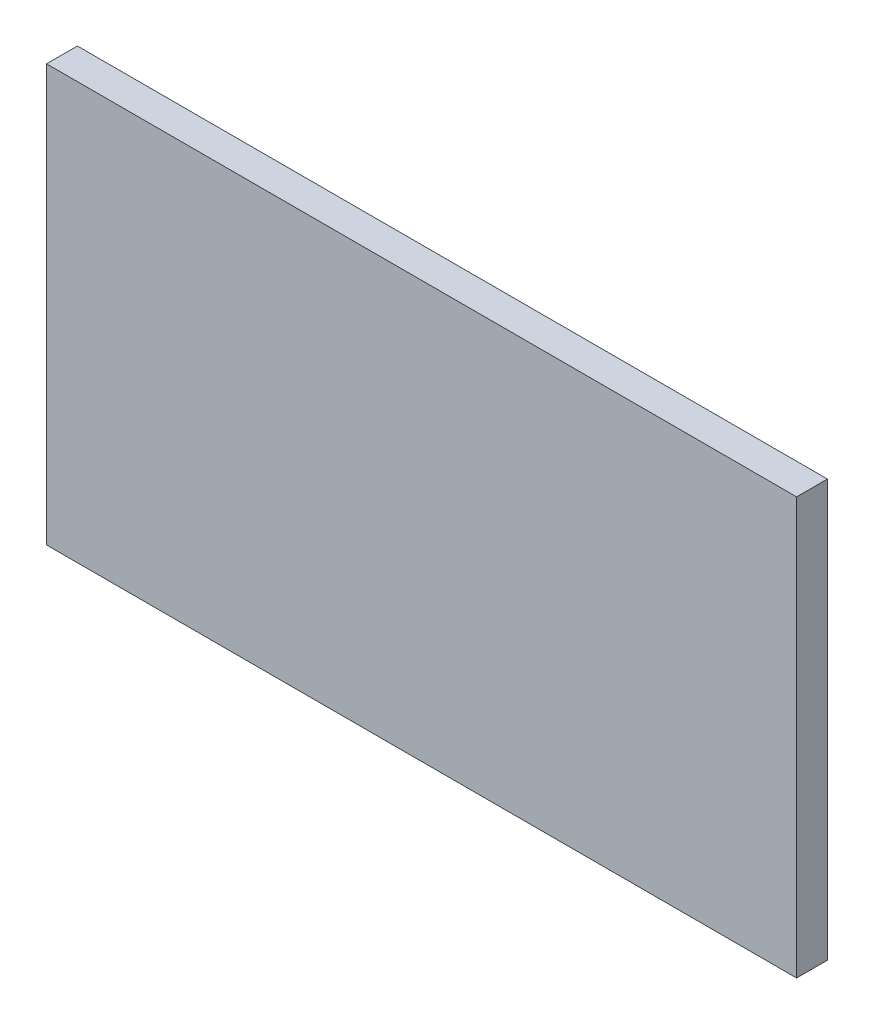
ISO-10303-21;
HEADER;
FILE_DESCRIPTION(('STEP AP214'),'2;1');
FILE_NAME('part.step','',(''),(''),'','','');
FILE_SCHEMA(('AUTOMOTIVE_DESIGN { 1 0 10303 214 1 1 1 1 }'));
ENDSEC;
DATA;
#1=APPLICATION_CONTEXT('core data for automotive mechanical design processes');
#2=APPLICATION_PROTOCOL_DEFINITION('international standard','automotive_design',2000,#1);
#3=PRODUCT_CONTEXT('',#1,'mechanical');
#4=PRODUCT('Part','Part','',(#3));
#5=PRODUCT_RELATED_PRODUCT_CATEGORY('part','',(#4));
#6=PRODUCT_DEFINITION_FORMATION('','',#4);
#7=PRODUCT_DEFINITION_CONTEXT('part definition',#1,'design');
#8=PRODUCT_DEFINITION('design','',#6,#7);
#9=PRODUCT_DEFINITION_SHAPE('','',#8);
#10=(LENGTH_UNIT() NAMED_UNIT(*) SI_UNIT(.MILLI.,.METRE.));
#11=(NAMED_UNIT(*) PLANE_ANGLE_UNIT() SI_UNIT($,.RADIAN.));
#12=(NAMED_UNIT(*) SI_UNIT($,.STERADIAN.) SOLID_ANGLE_UNIT());
#13=UNCERTAINTY_MEASURE_WITH_UNIT(LENGTH_MEASURE(1.E-05),#10,'distance_accuracy_value','');
#14=(GEOMETRIC_REPRESENTATION_CONTEXT(3) GLOBAL_UNCERTAINTY_ASSIGNED_CONTEXT((#13)) GLOBAL_UNIT_ASSIGNED_CONTEXT((#10,
#11,#12)) REPRESENTATION_CONTEXT('',''));
#15=CARTESIAN_POINT('',(0.,0.,0.));
#16=DIRECTION('',(0.,0.,1.));
#17=DIRECTION('',(1.,0.,0.));
#18=AXIS2_PLACEMENT_3D('',#15,#16,#17);
#19=CARTESIAN_POINT('',(-900.000000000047,-1514.13675308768,37.));
#20=DIRECTION('',(0.,-1.,0.));
#21=DIRECTION('',(0.,0.,-1.));
#22=AXIS2_PLACEMENT_3D('',#19,#20,#21);
#23=PLANE('',#22);
#24=DIRECTION('',(-1.,0.,0.));
#25=VECTOR('',#24,1.);
#26=CARTESIAN_POINT('',(-900.000000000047,-1514.13675308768,0.));
#27=LINE('',#26,#25);
#28=CARTESIAN_POINT('',(0.,-1514.13675308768,0.));
#29=VERTEX_POINT('',#28);
#30=CARTESIAN_POINT('',(-900.000000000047,-1514.13675308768,0.));
#31=VERTEX_POINT('',#30);
#32=EDGE_CURVE('E75',#29,#31,#27,.T.);
#33=ORIENTED_EDGE('',*,*,#32,.T.);
#34=DIRECTION('',(0.,0.,-1.));
#35=VECTOR('',#34,1.);
#36=CARTESIAN_POINT('',(-900.000000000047,-1514.13675308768,37.));
#37=LINE('',#36,#35);
#38=CARTESIAN_POINT('',(-900.000000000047,-1514.13675308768,37.));
#39=VERTEX_POINT('',#38);
#40=EDGE_CURVE('E11',#39,#31,#37,.T.);
#41=ORIENTED_EDGE('',*,*,#40,.F.);
#42=DIRECTION('',(-1.,0.,0.));
#43=VECTOR('',#42,1.);
#44=CARTESIAN_POINT('',(-900.000000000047,-1514.13675308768,37.));
#45=LINE('',#44,#43);
#46=CARTESIAN_POINT('',(0.,-1514.13675308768,37.));
#47=VERTEX_POINT('',#46);
#48=EDGE_CURVE('E93',#47,#39,#45,.T.);
#49=ORIENTED_EDGE('',*,*,#48,.F.);
#50=DIRECTION('',(0.,0.,-1.));
#51=VECTOR('',#50,1.);
#52=CARTESIAN_POINT('',(0.,-1514.13675308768,37.));
#53=LINE('',#52,#51);
#54=EDGE_CURVE('E87',#47,#29,#53,.T.);
#55=ORIENTED_EDGE('',*,*,#54,.T.);
#56=EDGE_LOOP('',(#33,#41,#49,#55));
#57=FACE_BOUND('',#56,.T.);
#58=ADVANCED_FACE('F31',(#57),#23,.F.);
#59=CARTESIAN_POINT('',(-900.000000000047,-1514.13675308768,37.));
#60=DIRECTION('',(1.,0.,0.));
#61=DIRECTION('',(0.,1.,0.));
#62=AXIS2_PLACEMENT_3D('',#59,#60,#61);
#63=PLANE('',#62);
#64=DIRECTION('',(0.,-1.,0.));
#65=VECTOR('',#64,1.);
#66=CARTESIAN_POINT('',(-900.000000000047,-1514.13675308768,0.));
#67=LINE('',#66,#65);
#68=CARTESIAN_POINT('',(-900.000000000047,-2014.13675308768,0.));
#69=VERTEX_POINT('',#68);
#70=EDGE_CURVE('E71',#31,#69,#67,.T.);
#71=ORIENTED_EDGE('',*,*,#70,.T.);
#72=DIRECTION('',(0.,0.,-1.));
#73=VECTOR('',#72,1.);
#74=CARTESIAN_POINT('',(-900.000000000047,-2014.13675308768,37.));
#75=LINE('',#74,#73);
#76=CARTESIAN_POINT('',(-900.000000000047,-2014.13675308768,37.));
#77=VERTEX_POINT('',#76);
#78=EDGE_CURVE('E38',#77,#69,#75,.T.);
#79=ORIENTED_EDGE('',*,*,#78,.F.);
#80=DIRECTION('',(0.,-1.,0.));
#81=VECTOR('',#80,1.);
#82=CARTESIAN_POINT('',(-900.000000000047,-1514.13675308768,37.));
#83=LINE('',#82,#81);
#84=EDGE_CURVE('E83',#39,#77,#83,.T.);
#85=ORIENTED_EDGE('',*,*,#84,.F.);
#86=ORIENTED_EDGE('',*,*,#40,.T.);
#87=EDGE_LOOP('',(#71,#79,#85,#86));
#88=FACE_BOUND('',#87,.T.);
#89=ADVANCED_FACE('F82',(#88),#63,.F.);
#90=CARTESIAN_POINT('',(2.46652466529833E-13,-2014.13675308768,37.));
#91=DIRECTION('',(0.,1.,0.));
#92=DIRECTION('',(0.,0.,1.));
#93=AXIS2_PLACEMENT_3D('',#90,#91,#92);
#94=PLANE('',#93);
#95=DIRECTION('',(1.,0.,0.));
#96=VECTOR('',#95,1.);
#97=CARTESIAN_POINT('',(2.46652466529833E-13,-2014.13675308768,0.));
#98=LINE('',#97,#96);
#99=CARTESIAN_POINT('',(2.46652466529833E-13,-2014.13675308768,0.));
#100=VERTEX_POINT('',#99);
#101=EDGE_CURVE('E76',#69,#100,#98,.T.);
#102=ORIENTED_EDGE('',*,*,#101,.T.);
#103=DIRECTION('',(0.,0.,-1.));
#104=VECTOR('',#103,1.);
#105=CARTESIAN_POINT('',(2.46652466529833E-13,-2014.13675308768,37.));
#106=LINE('',#105,#104);
#107=CARTESIAN_POINT('',(2.46652466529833E-13,-2014.13675308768,37.));
#108=VERTEX_POINT('',#107);
#109=EDGE_CURVE('E99',#108,#100,#106,.T.);
#110=ORIENTED_EDGE('',*,*,#109,.F.);
#111=DIRECTION('',(1.,0.,0.));
#112=VECTOR('',#111,1.);
#113=CARTESIAN_POINT('',(2.46652466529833E-13,-2014.13675308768,37.));
#114=LINE('',#113,#112);
#115=EDGE_CURVE('E50',#77,#108,#114,.T.);
#116=ORIENTED_EDGE('',*,*,#115,.F.);
#117=ORIENTED_EDGE('',*,*,#78,.T.);
#118=EDGE_LOOP('',(#102,#110,#116,#117));
#119=FACE_BOUND('',#118,.T.);
#120=ADVANCED_FACE('F102',(#119),#94,.F.);
#121=CARTESIAN_POINT('',(0.,-1514.13675308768,37.));
#122=DIRECTION('',(-1.,0.,0.));
#123=DIRECTION('',(0.,-1.,0.));
#124=AXIS2_PLACEMENT_3D('',#121,#122,#123);
#125=PLANE('',#124);
#126=DIRECTION('',(0.,1.,0.));
#127=VECTOR('',#126,1.);
#128=CARTESIAN_POINT('',(0.,-1514.13675308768,0.));
#129=LINE('',#128,#127);
#130=EDGE_CURVE('E91',#100,#29,#129,.T.);
#131=ORIENTED_EDGE('',*,*,#130,.T.);
#132=ORIENTED_EDGE('',*,*,#54,.F.);
#133=DIRECTION('',(0.,1.,0.));
#134=VECTOR('',#133,1.);
#135=CARTESIAN_POINT('',(0.,-1514.13675308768,37.));
#136=LINE('',#135,#134);
#137=EDGE_CURVE('E45',#108,#47,#136,.T.);
#138=ORIENTED_EDGE('',*,*,#137,.F.);
#139=ORIENTED_EDGE('',*,*,#109,.T.);
#140=EDGE_LOOP('',(#131,#132,#138,#139));
#141=FACE_BOUND('',#140,.T.);
#142=ADVANCED_FACE('F104',(#141),#125,.F.);
#143=CARTESIAN_POINT('',(-900.000000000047,-1514.13675308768,37.));
#144=DIRECTION('',(0.,0.,-1.));
#145=DIRECTION('',(-1.,0.,0.));
#146=AXIS2_PLACEMENT_3D('',#143,#144,#145);
#147=PLANE('',#146);
#148=ORIENTED_EDGE('',*,*,#48,.T.);
#149=ORIENTED_EDGE('',*,*,#84,.T.);
#150=ORIENTED_EDGE('',*,*,#115,.T.);
#151=ORIENTED_EDGE('',*,*,#137,.T.);
#152=EDGE_LOOP('',(#148,#149,#150,#151));
#153=FACE_BOUND('',#152,.T.);
#154=ADVANCED_FACE('F105',(#153),#147,.F.);
#155=CARTESIAN_POINT('',(-900.000000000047,-1514.13675308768,0.));
#156=DIRECTION('',(0.,0.,-1.));
#157=DIRECTION('',(-1.,0.,0.));
#158=AXIS2_PLACEMENT_3D('',#155,#156,#157);
#159=PLANE('',#158);
#160=ORIENTED_EDGE('',*,*,#32,.F.);
#161=ORIENTED_EDGE('',*,*,#130,.F.);
#162=ORIENTED_EDGE('',*,*,#101,.F.);
#163=ORIENTED_EDGE('',*,*,#70,.F.);
#164=EDGE_LOOP('',(#160,#161,#162,#163));
#165=FACE_BOUND('',#164,.T.);
#166=ADVANCED_FACE('F72',(#165),#159,.T.);
#167=CLOSED_SHELL('',(#58,#89,#120,#142,#154,#166));
#168=MANIFOLD_SOLID_BREP('B2',#167);
#169=ADVANCED_BREP_SHAPE_REPRESENTATION('',(#18,#168),#14);
#170=SHAPE_DEFINITION_REPRESENTATION(#9,#169);
ENDSEC;
END-ISO-10303-21;
